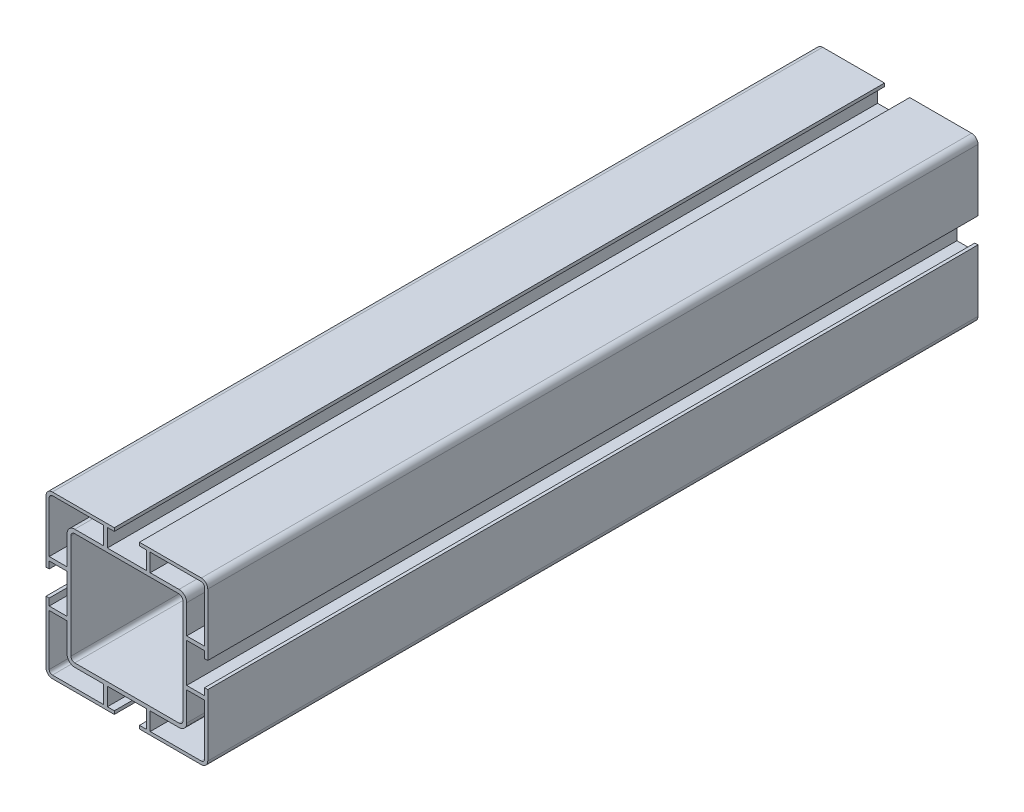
from build123d import *

# Parameters (mm, degrees)
EXTRUDE_1_DEPTH = 300


with BuildPart() as part:
    # Model → Extrude 1 (new body)
    with BuildSketch(Plane.XY):
        with BuildLine():
            Line((4962.155470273, 295.806589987), (4946.955470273, 295.806589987))
            Line((4946.955470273, 295.806589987), (4946.955470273, 302.756589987))
            Line((4946.955470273, 302.756589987), (4949.655470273, 302.756589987))
            Line((4949.655470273, 302.756589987), (4949.655470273, 304.006589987))
            Line((4949.655470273, 304.006589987), (4925.555470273, 304.006589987))
            ThreePointArc((4925.555470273, 304.006589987), (4923.78770332, 303.27435694), (4923.055470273, 301.506589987))
            Line((4923.055470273, 301.506589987), (4923.055470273, 277.406589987))
            Line((4923.055470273, 277.406589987), (4924.305470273, 277.406589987))
            Line((4924.305470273, 277.406589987), (4924.305470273, 280.106589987))
            Line((4924.305470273, 280.106589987), (4931.255470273, 280.106589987))
            Line((4931.255470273, 280.106589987), (4931.255470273, 264.906589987))
            Line((4931.255470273, 264.906589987), (4924.305470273, 264.906589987))
            Line((4924.305470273, 264.906589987), (4924.305470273, 267.606589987))
            Line((4924.305470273, 267.606589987), (4923.055470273, 267.606589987))
            Line((4923.055470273, 267.606589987), (4923.055470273, 243.506589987))
            ThreePointArc((4923.055470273, 243.506589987), (4923.78770332, 241.738823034), (4925.555470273, 241.006589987))
            Line((4925.555470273, 241.006589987), (4949.655470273, 241.006589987))
            Line((4949.655470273, 241.006589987), (4949.655470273, 242.256589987))
            Line((4949.655470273, 242.256589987), (4946.955470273, 242.256589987))
            Line((4946.955470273, 242.256589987), (4946.955470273, 249.206589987))
            Line((4946.955470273, 249.206589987), (4962.155470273, 249.206589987))
            Line((4962.155470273, 249.206589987), (4962.155470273, 242.256589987))
            Line((4962.155470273, 242.256589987), (4959.455470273, 242.256589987))
            Line((4959.455470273, 242.256589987), (4959.455470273, 241.006589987))
            Line((4959.455470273, 241.006589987), (4983.555470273, 241.006589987))
            ThreePointArc((4983.555470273, 241.006589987), (4985.323237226, 241.738823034), (4986.055470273, 243.506589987))
            Line((4986.055470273, 243.506589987), (4986.055470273, 267.606589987))
            Line((4986.055470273, 267.606589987), (4984.805470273, 267.606589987))
            Line((4984.805470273, 267.606589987), (4984.805470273, 264.906589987))
            Line((4984.805470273, 264.906589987), (4977.855470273, 264.906589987))
            Line((4977.855470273, 264.906589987), (4977.855470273, 280.106589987))
            Line((4977.855470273, 280.106589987), (4984.805470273, 280.106589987))
            Line((4984.805470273, 280.106589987), (4984.805470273, 277.406589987))
            Line((4984.805470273, 277.406589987), (4986.055470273, 277.406589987))
            Line((4986.055470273, 277.406589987), (4986.055470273, 301.506589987))
            ThreePointArc((4986.055470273, 301.506589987), (4985.323237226, 303.27435694), (4983.555470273, 304.006589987))
            Line((4983.555470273, 304.006589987), (4959.455470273, 304.006589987))
            Line((4959.455470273, 304.006589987), (4959.455470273, 302.756589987))
            Line((4959.455470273, 302.756589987), (4962.155470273, 302.756589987))
            Line((4962.155470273, 302.756589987), (4962.155470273, 295.806589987))
        make_face()
        with BuildLine():
            Line((4934.255470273, 249.206589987), (4945.455470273, 249.206589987))
            Line((4945.455470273, 249.206589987), (4945.455470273, 242.256589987))
            Line((4945.455470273, 242.256589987), (4925.555470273, 242.256589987))
            ThreePointArc((4925.555470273, 242.256589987), (4924.671586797, 242.62270651), (4924.305470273, 243.506589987))
            Line((4924.305470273, 243.506589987), (4924.305470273, 263.406589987))
            Line((4924.305470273, 263.406589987), (4931.255470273, 263.406589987))
            Line((4931.255470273, 263.406589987), (4931.255470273, 252.206589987))
            ThreePointArc((4931.255470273, 252.206589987), (4932.13414993, 250.085269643), (4934.255470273, 249.206589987))
        make_face(mode=Mode.SUBTRACT)
        with BuildLine():
            Line((4974.855470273, 295.806589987), (4963.655470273, 295.806589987))
            Line((4963.655470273, 295.806589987), (4963.655470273, 302.756589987))
            Line((4963.655470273, 302.756589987), (4983.555470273, 302.756589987))
            ThreePointArc((4983.555470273, 302.756589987), (4984.43935375, 302.390473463), (4984.805470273, 301.506589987))
            Line((4984.805470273, 301.506589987), (4984.805470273, 281.606589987))
            Line((4984.805470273, 281.606589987), (4977.855470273, 281.606589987))
            Line((4977.855470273, 281.606589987), (4977.855470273, 292.806589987))
            ThreePointArc((4977.855470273, 292.806589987), (4976.976790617, 294.92791033), (4974.855470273, 295.806589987))
        make_face(mode=Mode.SUBTRACT)
        with BuildLine():
            Line((4934.255470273, 294.306589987), (4974.855470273, 294.306589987))
            ThreePointArc((4974.855470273, 294.306589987), (4975.916130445, 293.867250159), (4976.355470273, 292.806589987))
            Line((4976.355470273, 292.806589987), (4976.355470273, 252.206589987))
            ThreePointArc((4976.355470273, 252.206589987), (4975.916130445, 251.145929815), (4974.855470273, 250.706589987))
            Line((4974.855470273, 250.706589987), (4934.255470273, 250.706589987))
            ThreePointArc((4934.255470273, 250.706589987), (4933.194810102, 251.145929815), (4932.755470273, 252.206589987))
            Line((4932.755470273, 252.206589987), (4932.755470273, 292.806589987))
            ThreePointArc((4932.755470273, 292.806589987), (4933.194810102, 293.867250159), (4934.255470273, 294.306589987))
        make_face(mode=Mode.SUBTRACT)
        with BuildLine():
            Line((4931.255470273, 292.806589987), (4931.255470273, 281.606589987))
            Line((4931.255470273, 281.606589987), (4924.305470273, 281.606589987))
            Line((4924.305470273, 281.606589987), (4924.305470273, 301.506589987))
            ThreePointArc((4924.305470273, 301.506589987), (4924.671586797, 302.390473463), (4925.555470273, 302.756589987))
            Line((4925.555470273, 302.756589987), (4945.455470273, 302.756589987))
            Line((4945.455470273, 302.756589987), (4945.455470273, 295.806589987))
            Line((4945.455470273, 295.806589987), (4934.255470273, 295.806589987))
            ThreePointArc((4934.255470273, 295.806589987), (4932.13414993, 294.92791033), (4931.255470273, 292.806589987))
        make_face(mode=Mode.SUBTRACT)
        with BuildLine():
            Line((4977.855470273, 252.206589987), (4977.855470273, 263.406589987))
            Line((4977.855470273, 263.406589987), (4984.805470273, 263.406589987))
            Line((4984.805470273, 263.406589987), (4984.805470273, 243.506589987))
            ThreePointArc((4984.805470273, 243.506589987), (4984.43935375, 242.62270651), (4983.555470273, 242.256589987))
            Line((4983.555470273, 242.256589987), (4963.655470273, 242.256589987))
            Line((4963.655470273, 242.256589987), (4963.655470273, 249.206589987))
            Line((4963.655470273, 249.206589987), (4974.855470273, 249.206589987))
            ThreePointArc((4974.855470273, 249.206589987), (4976.976790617, 250.085269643), (4977.855470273, 252.206589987))
        make_face(mode=Mode.SUBTRACT)
    extrude(amount=EXTRUDE_1_DEPTH)


solid = part.part
